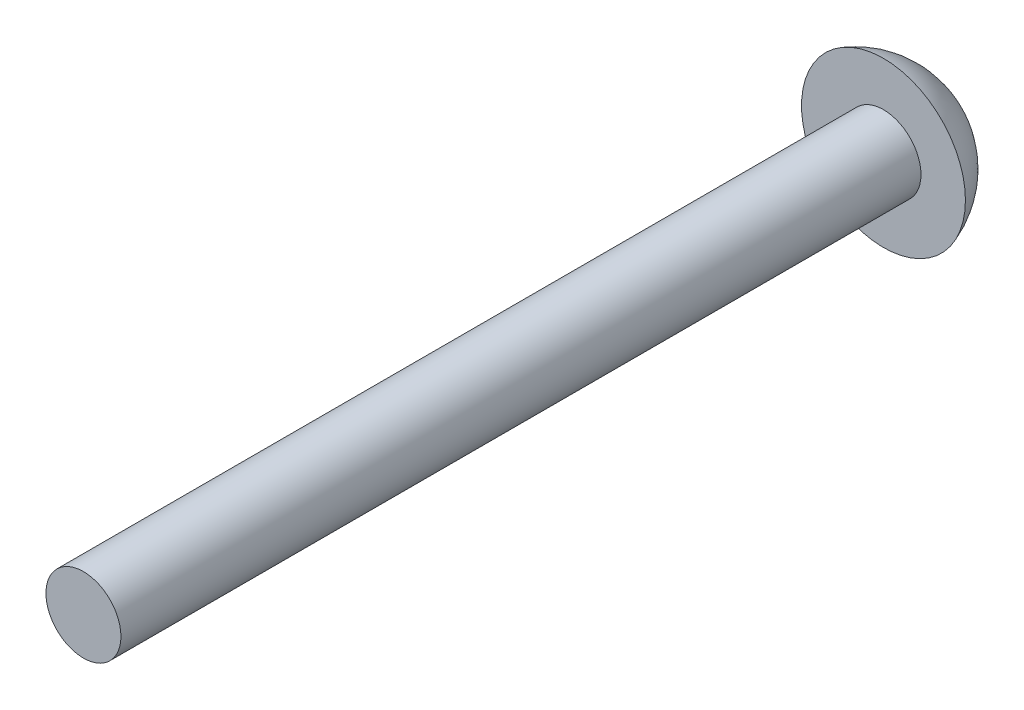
ISO-10303-21;
HEADER;
FILE_DESCRIPTION(('STEP AP214'),'2;1');
FILE_NAME('part.step','',(''),(''),'','','');
FILE_SCHEMA(('AUTOMOTIVE_DESIGN { 1 0 10303 214 1 1 1 1 }'));
ENDSEC;
DATA;
#1=APPLICATION_CONTEXT('core data for automotive mechanical design processes');
#2=APPLICATION_PROTOCOL_DEFINITION('international standard','automotive_design',2000,#1);
#3=PRODUCT_CONTEXT('',#1,'mechanical');
#4=PRODUCT('Part','Part','',(#3));
#5=PRODUCT_RELATED_PRODUCT_CATEGORY('part','',(#4));
#6=PRODUCT_DEFINITION_FORMATION('','',#4);
#7=PRODUCT_DEFINITION_CONTEXT('part definition',#1,'design');
#8=PRODUCT_DEFINITION('design','',#6,#7);
#9=PRODUCT_DEFINITION_SHAPE('','',#8);
#10=(LENGTH_UNIT() NAMED_UNIT(*) SI_UNIT(.MILLI.,.METRE.));
#11=(NAMED_UNIT(*) PLANE_ANGLE_UNIT() SI_UNIT($,.RADIAN.));
#12=(NAMED_UNIT(*) SI_UNIT($,.STERADIAN.) SOLID_ANGLE_UNIT());
#13=UNCERTAINTY_MEASURE_WITH_UNIT(LENGTH_MEASURE(1.E-05),#10,'distance_accuracy_value','');
#14=(GEOMETRIC_REPRESENTATION_CONTEXT(3) GLOBAL_UNCERTAINTY_ASSIGNED_CONTEXT((#13)) GLOBAL_UNIT_ASSIGNED_CONTEXT((#10,
#11,#12)) REPRESENTATION_CONTEXT('',''));
#15=CARTESIAN_POINT('',(0.,0.,0.));
#16=DIRECTION('',(0.,0.,1.));
#17=DIRECTION('',(1.,0.,0.));
#18=AXIS2_PLACEMENT_3D('',#15,#16,#17);
#19=CARTESIAN_POINT('',(0.,0.,16.));
#20=DIRECTION('',(0.,0.,-1.));
#21=DIRECTION('',(-1.,0.,0.));
#22=AXIS2_PLACEMENT_3D('',#19,#20,#21);
#23=CYLINDRICAL_SURFACE('',#22,0.75);
#24=CARTESIAN_POINT('',(0.,0.,16.));
#25=DIRECTION('',(0.,0.,1.));
#26=DIRECTION('',(1.,0.,0.));
#27=AXIS2_PLACEMENT_3D('',#24,#25,#26);
#28=CIRCLE('',#27,0.75);
#29=CARTESIAN_POINT('',(0.75,0.,16.));
#30=VERTEX_POINT('',#29);
#31=EDGE_CURVE('E10',#30,#30,#28,.T.);
#32=ORIENTED_EDGE('',*,*,#31,.F.);
#33=EDGE_LOOP('',(#32));
#34=FACE_BOUND('',#33,.T.);
#35=CARTESIAN_POINT('',(0.,0.,0.));
#36=DIRECTION('',(0.,0.,1.));
#37=DIRECTION('',(1.,0.,0.));
#38=AXIS2_PLACEMENT_3D('',#35,#36,#37);
#39=CIRCLE('',#38,0.75);
#40=CARTESIAN_POINT('',(0.75,0.,0.));
#41=VERTEX_POINT('',#40);
#42=EDGE_CURVE('E44',#41,#41,#39,.T.);
#43=ORIENTED_EDGE('',*,*,#42,.T.);
#44=EDGE_LOOP('',(#43));
#45=FACE_BOUND('',#44,.T.);
#46=ADVANCED_FACE('F39',(#34,#45),#23,.T.);
#47=CARTESIAN_POINT('',(0.,0.,16.));
#48=DIRECTION('',(0.,0.,1.));
#49=DIRECTION('',(1.,0.,0.));
#50=AXIS2_PLACEMENT_3D('',#47,#48,#49);
#51=PLANE('',#50);
#52=ORIENTED_EDGE('',*,*,#31,.T.);
#53=EDGE_LOOP('',(#52));
#54=FACE_BOUND('',#53,.T.);
#55=ADVANCED_FACE('F62',(#54),#51,.T.);
#56=CARTESIAN_POINT('',(0.,0.,0.));
#57=DIRECTION('',(0.,0.,1.));
#58=DIRECTION('',(1.,0.,0.));
#59=AXIS2_PLACEMENT_3D('',#56,#57,#58);
#60=PLANE('',#59);
#61=CARTESIAN_POINT('',(0.,0.,0.));
#62=DIRECTION('',(0.,0.,1.));
#63=DIRECTION('',(1.,0.,0.));
#64=AXIS2_PLACEMENT_3D('',#61,#62,#63);
#65=CIRCLE('',#64,1.63914016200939);
#66=CARTESIAN_POINT('',(1.63914016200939,0.,0.));
#67=VERTEX_POINT('',#66);
#68=EDGE_CURVE('E47',#67,#67,#65,.T.);
#69=ORIENTED_EDGE('',*,*,#68,.T.);
#70=EDGE_LOOP('',(#69));
#71=FACE_BOUND('',#70,.T.);
#72=ORIENTED_EDGE('',*,*,#42,.F.);
#73=EDGE_LOOP('',(#72));
#74=FACE_BOUND('',#73,.T.);
#75=ADVANCED_FACE('F57',(#71,#74),#60,.T.);
#76=CARTESIAN_POINT('',(0.,0.,0.557649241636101));
#77=DIRECTION('',(0.,0.,1.));
#78=DIRECTION('',(1.,0.,0.));
#79=AXIS2_PLACEMENT_3D('',#76,#77,#78);
#80=SPHERICAL_SURFACE('',#79,1.73140207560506);
#81=ORIENTED_EDGE('',*,*,#68,.F.);
#82=EDGE_LOOP('',(#81));
#83=FACE_BOUND('',#82,.T.);
#84=ADVANCED_FACE('F56',(#83),#80,.T.);
#85=CLOSED_SHELL('',(#46,#55,#75,#84));
#86=MANIFOLD_SOLID_BREP('B2',#85);
#87=ADVANCED_BREP_SHAPE_REPRESENTATION('',(#18,#86),#14);
#88=SHAPE_DEFINITION_REPRESENTATION(#9,#87);
ENDSEC;
END-ISO-10303-21;
